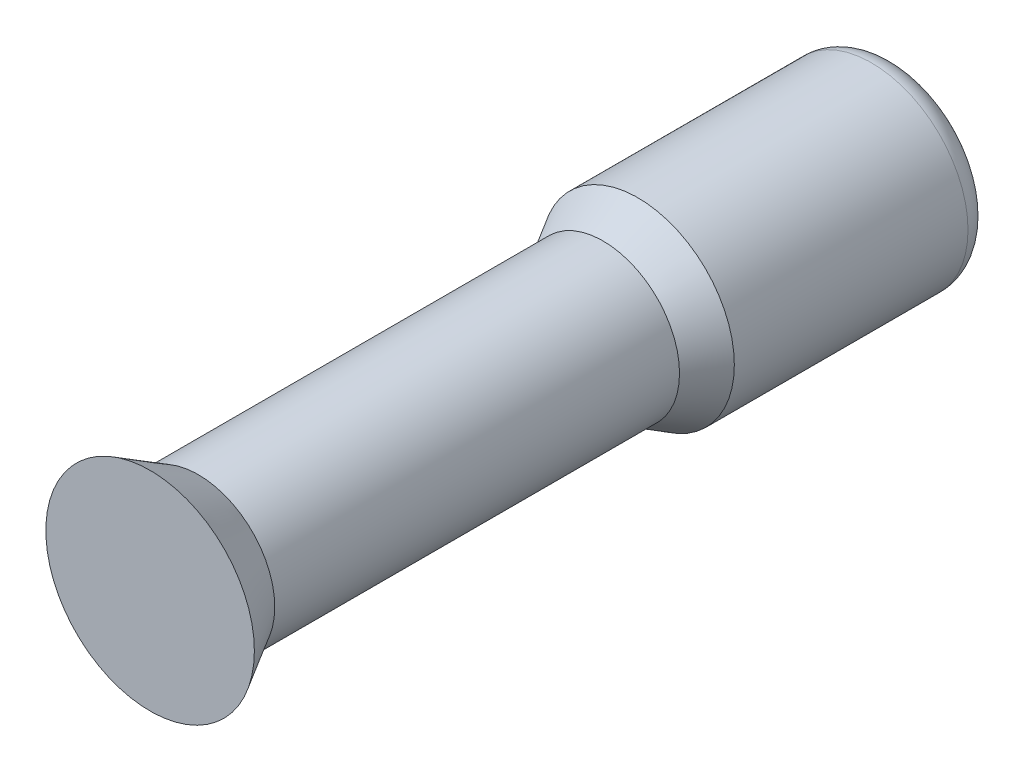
from build123d import *


with BuildPart() as part:
    # Sketch 1 → Revolve 1 (revolve)
    with BuildSketch(Plane(origin=(0, 0, 0), x_dir=(0, 0, -1), z_dir=(1, 0, 0)), mode=Mode.PRIVATE) as revolve_1_sk:
        with BuildLine():
            Line((0, 0), (12.267353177, 0))
            Line((12.267353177, 0), (12.267353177, 1.190625))
            ThreePointArc((12.267353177, 1.190625), (12.15111118, 1.471258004), (11.870478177, 1.5875))
            Line((11.870478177, 1.5875), (8.025553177, 1.5875))
            Line((8.025553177, 1.5875), (7.45363, 1.2573))
            Line((7.45363, 1.2573), (0.79375, 1.2573))
            Line((0.79375, 1.2573), (0, 1.715571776))
            Line((0, 1.715571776), (0, 0))
        make_face()
    revolve(revolve_1_sk.sketch.rotate(Axis((0, 0, 0), (0, 0, -1)), 90), axis=Axis((0, 0, 0), (0, 0, -1)))


solid = part.part
